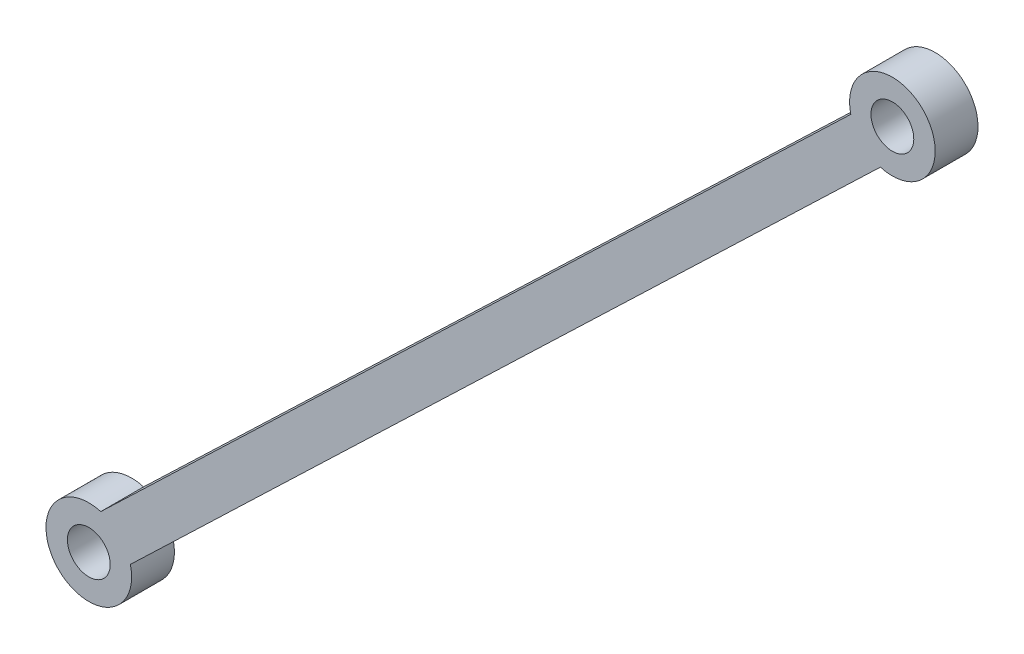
ISO-10303-21;
HEADER;
FILE_DESCRIPTION(('STEP AP214'),'2;1');
FILE_NAME('part.step','',(''),(''),'','','');
FILE_SCHEMA(('AUTOMOTIVE_DESIGN { 1 0 10303 214 1 1 1 1 }'));
ENDSEC;
DATA;
#1=APPLICATION_CONTEXT('core data for automotive mechanical design processes');
#2=APPLICATION_PROTOCOL_DEFINITION('international standard','automotive_design',2000,#1);
#3=PRODUCT_CONTEXT('',#1,'mechanical');
#4=PRODUCT('Part','Part','',(#3));
#5=PRODUCT_RELATED_PRODUCT_CATEGORY('part','',(#4));
#6=PRODUCT_DEFINITION_FORMATION('','',#4);
#7=PRODUCT_DEFINITION_CONTEXT('part definition',#1,'design');
#8=PRODUCT_DEFINITION('design','',#6,#7);
#9=PRODUCT_DEFINITION_SHAPE('','',#8);
#10=(LENGTH_UNIT() NAMED_UNIT(*) SI_UNIT(.MILLI.,.METRE.));
#11=(NAMED_UNIT(*) PLANE_ANGLE_UNIT() SI_UNIT($,.RADIAN.));
#12=(NAMED_UNIT(*) SI_UNIT($,.STERADIAN.) SOLID_ANGLE_UNIT());
#13=UNCERTAINTY_MEASURE_WITH_UNIT(LENGTH_MEASURE(1.E-05),#10,'distance_accuracy_value','');
#14=(GEOMETRIC_REPRESENTATION_CONTEXT(3) GLOBAL_UNCERTAINTY_ASSIGNED_CONTEXT((#13)) GLOBAL_UNIT_ASSIGNED_CONTEXT((#10,
#11,#12)) REPRESENTATION_CONTEXT('',''));
#15=CARTESIAN_POINT('',(0.,0.,0.));
#16=DIRECTION('',(0.,0.,1.));
#17=DIRECTION('',(1.,0.,0.));
#18=AXIS2_PLACEMENT_3D('',#15,#16,#17);
#19=CARTESIAN_POINT('',(13028.4701946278,5827.43950746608,-3.82197747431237));
#20=DIRECTION('',(1.14274294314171E-09,-2.92227260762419E-06,-0.99999999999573));
#21=DIRECTION('',(0.,0.99999999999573,-2.92227260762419E-06));
#22=AXIS2_PLACEMENT_3D('',#19,#20,#21);
#23=CYLINDRICAL_SURFACE('',#22,3.17499999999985);
#24=CARTESIAN_POINT('',(13028.4701946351,5827.43948890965,-10.1719774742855));
#25=DIRECTION('',(1.14274294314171E-09,-2.92227260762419E-06,-0.99999999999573));
#26=DIRECTION('',(0.,0.99999999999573,-2.92227260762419E-06));
#27=AXIS2_PLACEMENT_3D('',#24,#25,#26);
#28=CIRCLE('',#27,3.17499999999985);
#29=CARTESIAN_POINT('',(13028.4701946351,5830.61448890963,-10.171986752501));
#30=VERTEX_POINT('',#29);
#31=EDGE_CURVE('E90',#30,#30,#28,.T.);
#32=ORIENTED_EDGE('',*,*,#31,.T.);
#33=EDGE_LOOP('',(#32));
#34=FACE_BOUND('',#33,.T.);
#35=CARTESIAN_POINT('',(13028.4701946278,5827.43950746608,-3.82197747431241));
#36=DIRECTION('',(1.14274294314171E-09,-2.92227260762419E-06,-0.99999999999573));
#37=DIRECTION('',(0.,0.99999999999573,-2.92227260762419E-06));
#38=AXIS2_PLACEMENT_3D('',#35,#36,#37);
#39=CIRCLE('',#38,3.17499999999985);
#40=CARTESIAN_POINT('',(13028.4701946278,5830.61450746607,-3.82198675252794));
#41=VERTEX_POINT('',#40);
#42=EDGE_CURVE('E18',#41,#41,#39,.F.);
#43=ORIENTED_EDGE('',*,*,#42,.T.);
#44=EDGE_LOOP('',(#43));
#45=FACE_BOUND('',#44,.T.);
#46=ADVANCED_FACE('F14',(#34,#45),#23,.F.);
#47=CARTESIAN_POINT('',(12909.2896652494,5713.18533618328,-10.1716437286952));
#48=DIRECTION('',(-1.14274294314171E-09,2.92227260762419E-06,0.99999999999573));
#49=DIRECTION('',(0.,-0.99999999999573,2.92227260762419E-06));
#50=AXIS2_PLACEMENT_3D('',#47,#48,#49);
#51=CYLINDRICAL_SURFACE('',#50,3.17499999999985);
#52=CARTESIAN_POINT('',(12909.2896652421,5713.18535473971,-3.82164372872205));
#53=DIRECTION('',(-1.14274294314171E-09,2.92227260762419E-06,0.99999999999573));
#54=DIRECTION('',(0.,-0.99999999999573,2.92227260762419E-06));
#55=AXIS2_PLACEMENT_3D('',#52,#53,#54);
#56=CIRCLE('',#55,3.17499999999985);
#57=CARTESIAN_POINT('',(12909.2896652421,5710.01035473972,-3.82163445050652));
#58=VERTEX_POINT('',#57);
#59=EDGE_CURVE('E73',#58,#58,#56,.T.);
#60=ORIENTED_EDGE('',*,*,#59,.T.);
#61=EDGE_LOOP('',(#60));
#62=FACE_BOUND('',#61,.T.);
#63=CARTESIAN_POINT('',(12909.2896652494,5713.18533618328,-10.1716437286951));
#64=DIRECTION('',(-1.14274294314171E-09,2.92227260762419E-06,0.99999999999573));
#65=DIRECTION('',(0.,-0.99999999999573,2.92227260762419E-06));
#66=AXIS2_PLACEMENT_3D('',#63,#64,#65);
#67=CIRCLE('',#66,3.17499999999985);
#68=CARTESIAN_POINT('',(12909.2896652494,5710.01033618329,-10.1716344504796));
#69=VERTEX_POINT('',#68);
#70=EDGE_CURVE('E86',#69,#69,#67,.F.);
#71=ORIENTED_EDGE('',*,*,#70,.T.);
#72=EDGE_LOOP('',(#71));
#73=FACE_BOUND('',#72,.T.);
#74=ADVANCED_FACE('F127',(#62,#73),#51,.F.);
#75=CARTESIAN_POINT('',(13022.3032545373,5825.92577764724,-6.99697305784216));
#76=DIRECTION('',(-0.692029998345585,0.721868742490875,-2.11028808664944E-06));
#77=DIRECTION('',(-0.721868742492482,-0.692029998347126,0.));
#78=AXIS2_PLACEMENT_3D('',#75,#76,#77);
#79=PLANE('',#78);
#80=DIRECTION('',(0.721868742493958,0.692029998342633,-2.02147541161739E-06));
#81=VECTOR('',#80,1.);
#82=CARTESIAN_POINT('',(12911.0622148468,5719.28294179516,-3.82166154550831));
#83=LINE('',#82,#81);
#84=CARTESIAN_POINT('',(12911.0622148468,5719.28294179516,-3.82166154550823));
#85=VERTEX_POINT('',#84);
#86=CARTESIAN_POINT('',(13022.3032545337,5825.92578692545,-3.82197305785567));
#87=VERTEX_POINT('',#86);
#88=EDGE_CURVE('E58',#85,#87,#83,.T.);
#89=ORIENTED_EDGE('',*,*,#88,.T.);
#90=DIRECTION('',(1.14274774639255E-09,-2.92227263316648E-06,-0.99999999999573));
#91=VECTOR('',#90,1.);
#92=CARTESIAN_POINT('',(13022.3032545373,5825.92577764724,-6.99697305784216));
#93=LINE('',#92,#91);
#94=CARTESIAN_POINT('',(13022.3032545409,5825.92576836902,-10.1719730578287));
#95=VERTEX_POINT('',#94);
#96=EDGE_CURVE('E64',#95,#87,#93,.F.);
#97=ORIENTED_EDGE('',*,*,#96,.F.);
#98=DIRECTION('',(-0.721868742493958,-0.692029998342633,2.02147541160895E-06));
#99=VECTOR('',#98,1.);
#100=CARTESIAN_POINT('',(13022.3032545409,5825.92576836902,-10.1719730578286));
#101=LINE('',#100,#99);
#102=CARTESIAN_POINT('',(12911.062214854,5719.28292323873,-10.1716615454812));
#103=VERTEX_POINT('',#102);
#104=EDGE_CURVE('E61',#95,#103,#101,.T.);
#105=ORIENTED_EDGE('',*,*,#104,.T.);
#106=DIRECTION('',(1.14274774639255E-09,-2.92227263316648E-06,-0.99999999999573));
#107=VECTOR('',#106,1.);
#108=CARTESIAN_POINT('',(12911.0622148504,5719.28293251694,-6.99666154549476));
#109=LINE('',#108,#107);
#110=EDGE_CURVE('E53',#85,#103,#109,.T.);
#111=ORIENTED_EDGE('',*,*,#110,.F.);
#112=EDGE_LOOP('',(#89,#97,#105,#111));
#113=FACE_BOUND('',#112,.T.);
#114=ADVANCED_FACE('F55',(#113),#79,.T.);
#115=CARTESIAN_POINT('',(12909.2896652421,5713.18535473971,-3.82164372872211));
#116=DIRECTION('',(1.14274294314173E-09,-2.92227260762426E-06,-0.99999999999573));
#117=DIRECTION('',(0.,0.99999999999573,-2.92227260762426E-06));
#118=AXIS2_PLACEMENT_3D('',#115,#116,#117);
#119=CYLINDRICAL_SURFACE('',#118,6.35000000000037);
#120=ORIENTED_EDGE('',*,*,#110,.T.);
#121=CARTESIAN_POINT('',(12909.2896652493,5713.18533618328,-10.1716437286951));
#122=DIRECTION('',(1.14274294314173E-09,-2.92227260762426E-06,-0.99999999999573));
#123=DIRECTION('',(0.,0.99999999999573,-2.92227260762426E-06));
#124=AXIS2_PLACEMENT_3D('',#121,#122,#123);
#125=CIRCLE('',#124,6.35000000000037);
#126=CARTESIAN_POINT('',(12915.4566053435,5714.69905672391,-10.1716481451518));
#127=VERTEX_POINT('',#126);
#128=EDGE_CURVE('E84',#103,#127,#125,.F.);
#129=ORIENTED_EDGE('',*,*,#128,.T.);
#130=DIRECTION('',(1.14274294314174E-09,-2.92227260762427E-06,-0.99999999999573));
#131=VECTOR('',#130,1.);
#132=CARTESIAN_POINT('',(12915.4566053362,5714.69907528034,-3.82164814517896));
#133=LINE('',#132,#131);
#134=CARTESIAN_POINT('',(12915.4566053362,5714.69907528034,-3.821648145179));
#135=VERTEX_POINT('',#134);
#136=EDGE_CURVE('E70',#135,#127,#133,.T.);
#137=ORIENTED_EDGE('',*,*,#136,.F.);
#138=CARTESIAN_POINT('',(12909.2896652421,5713.18535473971,-3.82164372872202));
#139=DIRECTION('',(1.14274294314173E-09,-2.92227260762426E-06,-0.99999999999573));
#140=DIRECTION('',(0.,0.99999999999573,-2.92227260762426E-06));
#141=AXIS2_PLACEMENT_3D('',#138,#139,#140);
#142=CIRCLE('',#141,6.35000000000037);
#143=EDGE_CURVE('E68',#135,#85,#142,.T.);
#144=ORIENTED_EDGE('',*,*,#143,.T.);
#145=EDGE_LOOP('',(#120,#129,#137,#144));
#146=FACE_BOUND('',#145,.T.);
#147=ADVANCED_FACE('F69',(#146),#119,.T.);
#148=CARTESIAN_POINT('',(13025.2951948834,5827.44078147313,-3.82197748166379));
#149=DIRECTION('',(1.14274774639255E-09,-2.92227263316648E-06,-0.99999999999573));
#150=DIRECTION('',(0.,0.99999999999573,-2.92227263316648E-06));
#151=AXIS2_PLACEMENT_3D('',#148,#149,#150);
#152=PLANE('',#151);
#153=ORIENTED_EDGE('',*,*,#88,.F.);
#154=ORIENTED_EDGE('',*,*,#143,.F.);
#155=DIRECTION('',(-0.721868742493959,-0.692029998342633,2.02147541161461E-06));
#156=VECTOR('',#155,1.);
#157=CARTESIAN_POINT('',(13026.6976450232,5821.34192041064,-3.82195965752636));
#158=LINE('',#157,#156);
#159=CARTESIAN_POINT('',(13026.6976450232,5821.34192041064,-3.82195965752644));
#160=VERTEX_POINT('',#159);
#161=EDGE_CURVE('E79',#160,#135,#158,.T.);
#162=ORIENTED_EDGE('',*,*,#161,.F.);
#163=CARTESIAN_POINT('',(13028.4701946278,5827.43950746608,-3.82197747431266));
#164=DIRECTION('',(1.14274294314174E-09,-2.92227260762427E-06,-0.99999999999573));
#165=DIRECTION('',(0.,0.99999999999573,-2.92227260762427E-06));
#166=AXIS2_PLACEMENT_3D('',#163,#164,#165);
#167=CIRCLE('',#166,6.35000000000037);
#168=EDGE_CURVE('E78',#87,#160,#167,.T.);
#169=ORIENTED_EDGE('',*,*,#168,.F.);
#170=EDGE_LOOP('',(#153,#154,#162,#169));
#171=FACE_BOUND('',#170,.T.);
#172=ORIENTED_EDGE('',*,*,#59,.F.);
#173=EDGE_LOOP('',(#172));
#174=FACE_BOUND('',#173,.T.);
#175=ORIENTED_EDGE('',*,*,#42,.F.);
#176=EDGE_LOOP('',(#175));
#177=FACE_BOUND('',#176,.T.);
#178=ADVANCED_FACE('F75',(#171,#174,#177),#152,.F.);
#179=CARTESIAN_POINT('',(12915.4566053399,5714.69906600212,-6.99664814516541));
#180=DIRECTION('',(0.692029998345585,-0.721868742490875,2.11028808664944E-06));
#181=DIRECTION('',(0.721868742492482,0.692029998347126,0.));
#182=AXIS2_PLACEMENT_3D('',#179,#180,#181);
#183=PLANE('',#182);
#184=ORIENTED_EDGE('',*,*,#161,.T.);
#185=ORIENTED_EDGE('',*,*,#136,.T.);
#186=DIRECTION('',(0.721868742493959,0.692029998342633,-2.02147541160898E-06));
#187=VECTOR('',#186,1.);
#188=CARTESIAN_POINT('',(12915.4566053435,5714.69905672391,-10.1716481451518));
#189=LINE('',#188,#187);
#190=CARTESIAN_POINT('',(13026.6976450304,5821.34190185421,-10.1719596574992));
#191=VERTEX_POINT('',#190);
#192=EDGE_CURVE('E33',#127,#191,#189,.T.);
#193=ORIENTED_EDGE('',*,*,#192,.T.);
#194=DIRECTION('',(1.14274774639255E-09,-2.92227263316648E-06,-0.99999999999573));
#195=VECTOR('',#194,1.);
#196=CARTESIAN_POINT('',(13026.6976450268,5821.34191113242,-6.99695965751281));
#197=LINE('',#196,#195);
#198=EDGE_CURVE('E24',#160,#191,#197,.T.);
#199=ORIENTED_EDGE('',*,*,#198,.F.);
#200=EDGE_LOOP('',(#184,#185,#193,#199));
#201=FACE_BOUND('',#200,.T.);
#202=ADVANCED_FACE('F105',(#201),#183,.T.);
#203=CARTESIAN_POINT('',(12897.5936124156,5795.49988142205,-10.1718842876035));
#204=DIRECTION('',(-1.14274774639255E-09,2.92227263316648E-06,0.99999999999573));
#205=DIRECTION('',(0.,-0.99999999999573,2.92227263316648E-06));
#206=AXIS2_PLACEMENT_3D('',#203,#204,#205);
#207=PLANE('',#206);
#208=ORIENTED_EDGE('',*,*,#104,.F.);
#209=CARTESIAN_POINT('',(13028.4701946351,5827.43948890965,-10.1719774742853));
#210=DIRECTION('',(1.14274294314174E-09,-2.92227260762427E-06,-0.99999999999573));
#211=DIRECTION('',(0.,0.99999999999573,-2.92227260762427E-06));
#212=AXIS2_PLACEMENT_3D('',#209,#210,#211);
#213=CIRCLE('',#212,6.35000000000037);
#214=EDGE_CURVE('E9',#191,#95,#213,.F.);
#215=ORIENTED_EDGE('',*,*,#214,.F.);
#216=ORIENTED_EDGE('',*,*,#192,.F.);
#217=ORIENTED_EDGE('',*,*,#128,.F.);
#218=EDGE_LOOP('',(#208,#215,#216,#217));
#219=FACE_BOUND('',#218,.T.);
#220=ORIENTED_EDGE('',*,*,#70,.F.);
#221=EDGE_LOOP('',(#220));
#222=FACE_BOUND('',#221,.T.);
#223=ORIENTED_EDGE('',*,*,#31,.F.);
#224=EDGE_LOOP('',(#223));
#225=FACE_BOUND('',#224,.T.);
#226=ADVANCED_FACE('F112',(#219,#222,#225),#207,.F.);
#227=CARTESIAN_POINT('',(13028.4701946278,5827.43950746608,-3.82197747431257));
#228=DIRECTION('',(1.14274294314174E-09,-2.92227260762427E-06,-0.99999999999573));
#229=DIRECTION('',(0.,0.99999999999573,-2.92227260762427E-06));
#230=AXIS2_PLACEMENT_3D('',#227,#228,#229);
#231=CYLINDRICAL_SURFACE('',#230,6.35000000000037);
#232=ORIENTED_EDGE('',*,*,#198,.T.);
#233=ORIENTED_EDGE('',*,*,#214,.T.);
#234=ORIENTED_EDGE('',*,*,#96,.T.);
#235=ORIENTED_EDGE('',*,*,#168,.T.);
#236=EDGE_LOOP('',(#232,#233,#234,#235));
#237=FACE_BOUND('',#236,.T.);
#238=ADVANCED_FACE('F16',(#237),#231,.T.);
#239=CLOSED_SHELL('',(#46,#74,#114,#147,#178,#202,#226,#238));
#240=MANIFOLD_SOLID_BREP('B1',#239);
#241=ADVANCED_BREP_SHAPE_REPRESENTATION('',(#18,#240),#14);
#242=SHAPE_DEFINITION_REPRESENTATION(#9,#241);
ENDSEC;
END-ISO-10303-21;
